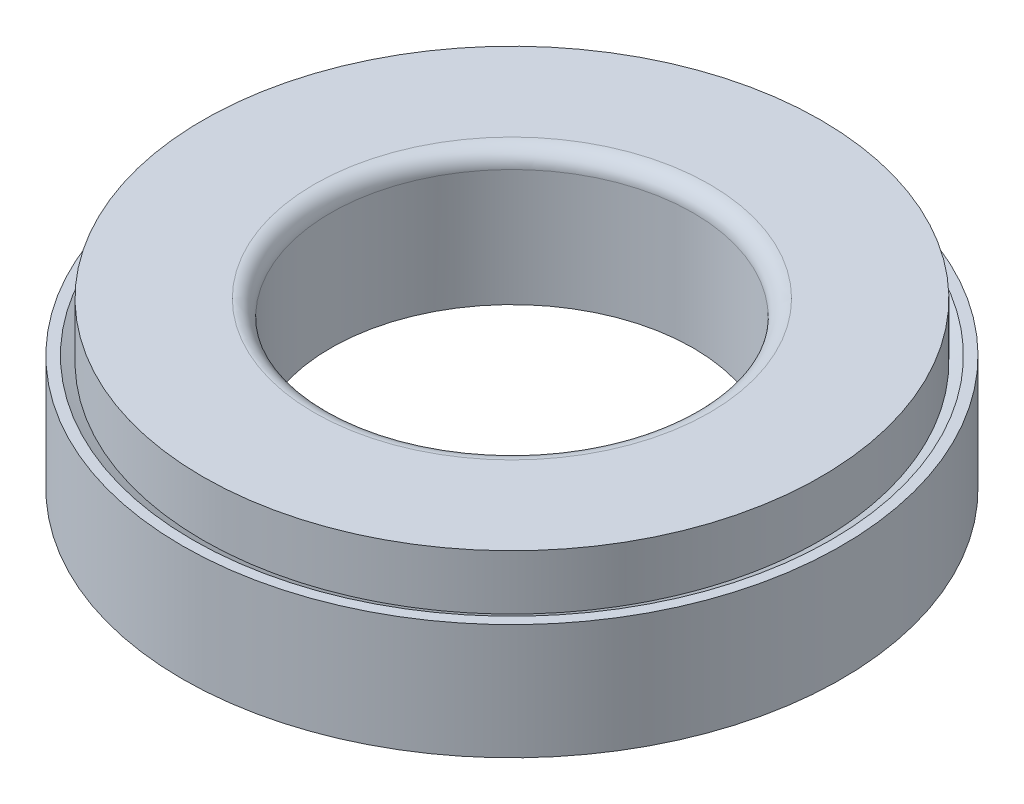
ISO-10303-21;
HEADER;
FILE_DESCRIPTION(('STEP AP214'),'2;1');
FILE_NAME('part.step','',(''),(''),'','','');
FILE_SCHEMA(('AUTOMOTIVE_DESIGN { 1 0 10303 214 1 1 1 1 }'));
ENDSEC;
DATA;
#1=APPLICATION_CONTEXT('core data for automotive mechanical design processes');
#2=APPLICATION_PROTOCOL_DEFINITION('international standard','automotive_design',2000,#1);
#3=PRODUCT_CONTEXT('',#1,'mechanical');
#4=PRODUCT('Part','Part','',(#3));
#5=PRODUCT_RELATED_PRODUCT_CATEGORY('part','',(#4));
#6=PRODUCT_DEFINITION_FORMATION('','',#4);
#7=PRODUCT_DEFINITION_CONTEXT('part definition',#1,'design');
#8=PRODUCT_DEFINITION('design','',#6,#7);
#9=PRODUCT_DEFINITION_SHAPE('','',#8);
#10=(LENGTH_UNIT() NAMED_UNIT(*) SI_UNIT(.MILLI.,.METRE.));
#11=(NAMED_UNIT(*) PLANE_ANGLE_UNIT() SI_UNIT($,.RADIAN.));
#12=(NAMED_UNIT(*) SI_UNIT($,.STERADIAN.) SOLID_ANGLE_UNIT());
#13=UNCERTAINTY_MEASURE_WITH_UNIT(LENGTH_MEASURE(1.E-05),#10,'distance_accuracy_value','');
#14=(GEOMETRIC_REPRESENTATION_CONTEXT(3) GLOBAL_UNCERTAINTY_ASSIGNED_CONTEXT((#13)) GLOBAL_UNIT_ASSIGNED_CONTEXT((#10,
#11,#12)) REPRESENTATION_CONTEXT('',''));
#15=CARTESIAN_POINT('',(0.,0.,0.));
#16=DIRECTION('',(0.,0.,1.));
#17=DIRECTION('',(1.,0.,0.));
#18=AXIS2_PLACEMENT_3D('',#15,#16,#17);
#19=CARTESIAN_POINT('',(0.,20.,0.));
#20=DIRECTION('',(0.,-1.,0.));
#21=DIRECTION('',(0.,0.,-1.));
#22=AXIS2_PLACEMENT_3D('',#19,#20,#21);
#23=CYLINDRICAL_SURFACE('',#22,37.5);
#24=CARTESIAN_POINT('',(0.,13.3200185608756,0.));
#25=DIRECTION('',(0.,1.,0.));
#26=DIRECTION('',(0.,0.,1.));
#27=AXIS2_PLACEMENT_3D('',#24,#25,#26);
#28=CIRCLE('',#27,37.5);
#29=CARTESIAN_POINT('',(0.,13.3200185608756,37.5));
#30=VERTEX_POINT('',#29);
#31=EDGE_CURVE('P0_E29',#30,#30,#28,.T.);
#32=ORIENTED_EDGE('',*,*,#31,.T.);
#33=EDGE_LOOP('',(#32));
#34=FACE_BOUND('',#33,.T.);
#35=CARTESIAN_POINT('',(0.,20.,0.));
#36=DIRECTION('',(0.,1.,0.));
#37=DIRECTION('',(0.,0.,1.));
#38=AXIS2_PLACEMENT_3D('',#35,#36,#37);
#39=CIRCLE('',#38,37.5);
#40=CARTESIAN_POINT('',(0.,20.,37.5));
#41=VERTEX_POINT('',#40);
#42=EDGE_CURVE('P0_E25',#41,#41,#39,.T.);
#43=ORIENTED_EDGE('',*,*,#42,.F.);
#44=EDGE_LOOP('',(#43));
#45=FACE_BOUND('',#44,.T.);
#46=ADVANCED_FACE('P0_F14',(#34,#45),#23,.T.);
#47=CARTESIAN_POINT('',(0.,20.,0.));
#48=DIRECTION('',(0.,1.,0.));
#49=DIRECTION('',(0.,0.,1.));
#50=AXIS2_PLACEMENT_3D('',#47,#48,#49);
#51=PLANE('',#50);
#52=CARTESIAN_POINT('',(0.,20.,0.));
#53=DIRECTION('',(0.,1.,0.));
#54=DIRECTION('',(0.,0.,1.));
#55=AXIS2_PLACEMENT_3D('',#52,#53,#54);
#56=CIRCLE('',#55,24.);
#57=CARTESIAN_POINT('',(0.,20.,24.));
#58=VERTEX_POINT('',#57);
#59=EDGE_CURVE('P0_E21',#58,#58,#56,.F.);
#60=ORIENTED_EDGE('',*,*,#59,.T.);
#61=EDGE_LOOP('',(#60));
#62=FACE_BOUND('',#61,.T.);
#63=ORIENTED_EDGE('',*,*,#42,.T.);
#64=EDGE_LOOP('',(#63));
#65=FACE_BOUND('',#64,.T.);
#66=ADVANCED_FACE('P0_F92',(#62,#65),#51,.T.);
#67=CARTESIAN_POINT('',(0.,83.7446428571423,0.));
#68=DIRECTION('',(-1.,0.,0.));
#69=DIRECTION('',(0.,-1.,0.));
#70=AXIS2_PLACEMENT_3D('',#67,#68,#69);
#71=SPHERICAL_SURFACE('',#70,79.7864506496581);
#72=CARTESIAN_POINT('',(0.,83.7446428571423,0.));
#73=DIRECTION('',(0.,1.,0.));
#74=DIRECTION('',(0.,0.,1.));
#75=AXIS2_PLACEMENT_3D('',#72,#73,#74);
#76=SPHERICAL_SURFACE('',#75,79.7864506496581);
#77=CARTESIAN_POINT('',(0.,8.40000000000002,0.));
#78=DIRECTION('',(0.,1.,0.));
#79=DIRECTION('',(0.,0.,1.));
#80=AXIS2_PLACEMENT_3D('',#77,#78,#79);
#81=CIRCLE('',#80,26.25);
#82=CARTESIAN_POINT('',(0.,8.40000000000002,26.25));
#83=VERTEX_POINT('',#82);
#84=EDGE_CURVE('P0_E49',#83,#83,#81,.T.);
#85=ORIENTED_EDGE('',*,*,#84,.T.);
#86=EDGE_LOOP('',(#85));
#87=FACE_BOUND('',#86,.T.);
#88=ORIENTED_EDGE('',*,*,#31,.F.);
#89=EDGE_LOOP('',(#88));
#90=FACE_BOUND('',#89,.T.);
#91=ADVANCED_FACE('P0_F53',(#87,#90),#76,.T.);
#92=CARTESIAN_POINT('',(0.,3.8,0.));
#93=DIRECTION('',(0.,1.,0.));
#94=DIRECTION('',(0.,0.,1.));
#95=AXIS2_PLACEMENT_3D('',#92,#93,#94);
#96=CYLINDRICAL_SURFACE('',#95,26.25);
#97=CARTESIAN_POINT('',(0.,6.1,0.));
#98=DIRECTION('',(0.,1.,0.));
#99=DIRECTION('',(0.,0.,1.));
#100=AXIS2_PLACEMENT_3D('',#97,#98,#99);
#101=CIRCLE('',#100,26.25);
#102=CARTESIAN_POINT('',(0.,6.1,26.25));
#103=VERTEX_POINT('',#102);
#104=EDGE_CURVE('P0_E40',#103,#103,#101,.T.);
#105=ORIENTED_EDGE('',*,*,#104,.F.);
#106=EDGE_LOOP('',(#105));
#107=FACE_BOUND('',#106,.T.);
#108=CARTESIAN_POINT('',(0.,3.8,0.));
#109=DIRECTION('',(0.,1.,0.));
#110=DIRECTION('',(0.,0.,1.));
#111=AXIS2_PLACEMENT_3D('',#108,#109,#110);
#112=CIRCLE('',#111,26.25);
#113=CARTESIAN_POINT('',(0.,3.8,26.25));
#114=VERTEX_POINT('',#113);
#115=EDGE_CURVE('P0_E33',#114,#114,#112,.T.);
#116=ORIENTED_EDGE('',*,*,#115,.T.);
#117=EDGE_LOOP('',(#116));
#118=FACE_BOUND('',#117,.T.);
#119=ADVANCED_FACE('P0_F75',(#107,#118),#96,.T.);
#120=CARTESIAN_POINT('',(0.,3.8,0.));
#121=DIRECTION('',(0.,1.,0.));
#122=DIRECTION('',(0.,0.,1.));
#123=AXIS2_PLACEMENT_3D('',#120,#121,#122);
#124=PLANE('',#123);
#125=CARTESIAN_POINT('',(0.,3.8,0.));
#126=DIRECTION('',(0.,-1.,0.));
#127=DIRECTION('',(0.,0.,-1.));
#128=AXIS2_PLACEMENT_3D('',#125,#126,#127);
#129=CIRCLE('',#128,22.);
#130=CARTESIAN_POINT('',(0.,3.8,-22.));
#131=VERTEX_POINT('',#130);
#132=EDGE_CURVE('P0_E37',#131,#131,#129,.T.);
#133=ORIENTED_EDGE('',*,*,#132,.F.);
#134=EDGE_LOOP('',(#133));
#135=FACE_BOUND('',#134,.T.);
#136=ORIENTED_EDGE('',*,*,#115,.F.);
#137=EDGE_LOOP('',(#136));
#138=FACE_BOUND('',#137,.T.);
#139=ADVANCED_FACE('P0_F78',(#135,#138),#124,.F.);
#140=CARTESIAN_POINT('',(0.,20.,0.));
#141=DIRECTION('',(0.,-1.,0.));
#142=DIRECTION('',(0.,0.,-1.));
#143=AXIS2_PLACEMENT_3D('',#140,#141,#142);
#144=CYLINDRICAL_SURFACE('',#143,22.);
#145=CARTESIAN_POINT('',(0.,18.,0.));
#146=DIRECTION('',(0.,1.,0.));
#147=DIRECTION('',(0.,0.,1.));
#148=AXIS2_PLACEMENT_3D('',#145,#146,#147);
#149=CIRCLE('',#148,22.);
#150=CARTESIAN_POINT('',(0.,18.,22.));
#151=VERTEX_POINT('',#150);
#152=EDGE_CURVE('P0_E10',#151,#151,#149,.T.);
#153=ORIENTED_EDGE('',*,*,#152,.T.);
#154=EDGE_LOOP('',(#153));
#155=FACE_BOUND('',#154,.T.);
#156=ORIENTED_EDGE('',*,*,#132,.T.);
#157=EDGE_LOOP('',(#156));
#158=FACE_BOUND('',#157,.T.);
#159=ADVANCED_FACE('P0_F71',(#155,#158),#144,.F.);
#160=CARTESIAN_POINT('',(-26.25,6.1,0.));
#161=DIRECTION('',(0.,-1.,0.));
#162=DIRECTION('',(0.,0.,-1.));
#163=AXIS2_PLACEMENT_3D('',#160,#161,#162);
#164=PLANE('',#163);
#165=CARTESIAN_POINT('',(0.,6.1,0.));
#166=DIRECTION('',(0.,1.,0.));
#167=DIRECTION('',(0.,0.,1.));
#168=AXIS2_PLACEMENT_3D('',#165,#166,#167);
#169=CIRCLE('',#168,24.125);
#170=CARTESIAN_POINT('',(0.,6.1,24.125));
#171=VERTEX_POINT('',#170);
#172=EDGE_CURVE('P0_E43',#171,#171,#169,.T.);
#173=ORIENTED_EDGE('',*,*,#172,.F.);
#174=EDGE_LOOP('',(#173));
#175=FACE_BOUND('',#174,.T.);
#176=ORIENTED_EDGE('',*,*,#104,.T.);
#177=EDGE_LOOP('',(#176));
#178=FACE_BOUND('',#177,.T.);
#179=ADVANCED_FACE('P0_F65',(#175,#178),#164,.F.);
#180=CARTESIAN_POINT('',(0.,20.,0.));
#181=DIRECTION('',(0.,1.,0.));
#182=DIRECTION('',(0.,0.,1.));
#183=AXIS2_PLACEMENT_3D('',#180,#181,#182);
#184=CYLINDRICAL_SURFACE('',#183,24.125);
#185=CARTESIAN_POINT('',(0.,8.40000000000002,0.));
#186=DIRECTION('',(0.,1.,0.));
#187=DIRECTION('',(0.,0.,1.));
#188=AXIS2_PLACEMENT_3D('',#185,#186,#187);
#189=CIRCLE('',#188,24.125);
#190=CARTESIAN_POINT('',(0.,8.40000000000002,24.125));
#191=VERTEX_POINT('',#190);
#192=EDGE_CURVE('P0_E46',#191,#191,#189,.T.);
#193=ORIENTED_EDGE('',*,*,#192,.F.);
#194=EDGE_LOOP('',(#193));
#195=FACE_BOUND('',#194,.T.);
#196=ORIENTED_EDGE('',*,*,#172,.T.);
#197=EDGE_LOOP('',(#196));
#198=FACE_BOUND('',#197,.T.);
#199=ADVANCED_FACE('P0_F59',(#195,#198),#184,.T.);
#200=CARTESIAN_POINT('',(-26.25,8.40000000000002,0.));
#201=DIRECTION('',(0.,1.,0.));
#202=DIRECTION('',(0.,0.,1.));
#203=AXIS2_PLACEMENT_3D('',#200,#201,#202);
#204=PLANE('',#203);
#205=ORIENTED_EDGE('',*,*,#84,.F.);
#206=EDGE_LOOP('',(#205));
#207=FACE_BOUND('',#206,.T.);
#208=ORIENTED_EDGE('',*,*,#192,.T.);
#209=EDGE_LOOP('',(#208));
#210=FACE_BOUND('',#209,.T.);
#211=ADVANCED_FACE('P0_F56',(#207,#210),#204,.F.);
#212=CARTESIAN_POINT('',(0.,18.,0.));
#213=DIRECTION('',(0.,1.,0.));
#214=DIRECTION('',(0.,0.,1.));
#215=AXIS2_PLACEMENT_3D('',#212,#213,#214);
#216=TOROIDAL_SURFACE('',#215,24.,2.);
#217=ORIENTED_EDGE('',*,*,#152,.F.);
#218=EDGE_LOOP('',(#217));
#219=FACE_BOUND('',#218,.T.);
#220=ORIENTED_EDGE('',*,*,#59,.F.);
#221=EDGE_LOOP('',(#220));
#222=FACE_BOUND('',#221,.T.);
#223=ADVANCED_FACE('P0_F16',(#219,#222),#216,.T.);
#224=CLOSED_SHELL('',(#46,#66,#91,#119,#139,#159,#179,#199,#211,#223));
#225=MANIFOLD_SOLID_BREP('P0_B1',#224);
#226=CARTESIAN_POINT('',(0.,14.,0.));
#227=DIRECTION('',(0.,-1.,0.));
#228=DIRECTION('',(0.,0.,-1.));
#229=AXIS2_PLACEMENT_3D('',#226,#227,#228);
#230=CYLINDRICAL_SURFACE('',#229,40.);
#231=CARTESIAN_POINT('',(0.,14.,0.));
#232=DIRECTION('',(0.,1.,0.));
#233=DIRECTION('',(0.,0.,1.));
#234=AXIS2_PLACEMENT_3D('',#231,#232,#233);
#235=CIRCLE('',#234,40.);
#236=CARTESIAN_POINT('',(0.,14.,40.));
#237=VERTEX_POINT('',#236);
#238=EDGE_CURVE('P1_E9',#237,#237,#235,.T.);
#239=ORIENTED_EDGE('',*,*,#238,.F.);
#240=EDGE_LOOP('',(#239));
#241=FACE_BOUND('',#240,.T.);
#242=CARTESIAN_POINT('',(0.,0.,0.));
#243=DIRECTION('',(0.,1.,0.));
#244=DIRECTION('',(0.,0.,1.));
#245=AXIS2_PLACEMENT_3D('',#242,#243,#244);
#246=CIRCLE('',#245,40.);
#247=CARTESIAN_POINT('',(0.,0.,40.));
#248=VERTEX_POINT('',#247);
#249=EDGE_CURVE('P1_E20',#248,#248,#246,.T.);
#250=ORIENTED_EDGE('',*,*,#249,.T.);
#251=EDGE_LOOP('',(#250));
#252=FACE_BOUND('',#251,.T.);
#253=ADVANCED_FACE('P1_F13',(#241,#252),#230,.T.);
#254=CARTESIAN_POINT('',(0.,14.,0.));
#255=DIRECTION('',(0.,1.,0.));
#256=DIRECTION('',(0.,0.,1.));
#257=AXIS2_PLACEMENT_3D('',#254,#255,#256);
#258=PLANE('',#257);
#259=CARTESIAN_POINT('',(0.,14.,0.));
#260=DIRECTION('',(0.,1.,0.));
#261=DIRECTION('',(0.,0.,1.));
#262=AXIS2_PLACEMENT_3D('',#259,#260,#261);
#263=CIRCLE('',#262,38.75);
#264=CARTESIAN_POINT('',(0.,14.,38.75));
#265=VERTEX_POINT('',#264);
#266=EDGE_CURVE('P1_E35',#265,#265,#263,.T.);
#267=ORIENTED_EDGE('',*,*,#266,.F.);
#268=EDGE_LOOP('',(#267));
#269=FACE_BOUND('',#268,.T.);
#270=ORIENTED_EDGE('',*,*,#238,.T.);
#271=EDGE_LOOP('',(#270));
#272=FACE_BOUND('',#271,.T.);
#273=ADVANCED_FACE('P1_F55',(#269,#272),#258,.T.);
#274=CARTESIAN_POINT('',(0.,0.,0.));
#275=DIRECTION('',(0.,1.,0.));
#276=DIRECTION('',(0.,0.,1.));
#277=AXIS2_PLACEMENT_3D('',#274,#275,#276);
#278=PLANE('',#277);
#279=CARTESIAN_POINT('',(0.,0.,0.));
#280=DIRECTION('',(0.,-1.,0.));
#281=DIRECTION('',(0.,0.,-1.));
#282=AXIS2_PLACEMENT_3D('',#279,#280,#281);
#283=CIRCLE('',#282,30.5);
#284=CARTESIAN_POINT('',(0.,0.,-30.5));
#285=VERTEX_POINT('',#284);
#286=EDGE_CURVE('P1_E27',#285,#285,#283,.T.);
#287=ORIENTED_EDGE('',*,*,#286,.F.);
#288=EDGE_LOOP('',(#287));
#289=FACE_BOUND('',#288,.T.);
#290=ORIENTED_EDGE('',*,*,#249,.F.);
#291=EDGE_LOOP('',(#290));
#292=FACE_BOUND('',#291,.T.);
#293=ADVANCED_FACE('P1_F60',(#289,#292),#278,.F.);
#294=CARTESIAN_POINT('',(0.,7.,0.));
#295=DIRECTION('',(0.,-1.,0.));
#296=DIRECTION('',(0.,0.,-1.));
#297=AXIS2_PLACEMENT_3D('',#294,#295,#296);
#298=CYLINDRICAL_SURFACE('',#297,30.5);
#299=CARTESIAN_POINT('',(0.,7.,0.));
#300=DIRECTION('',(0.,-1.,0.));
#301=DIRECTION('',(0.,0.,-1.));
#302=AXIS2_PLACEMENT_3D('',#299,#300,#301);
#303=CIRCLE('',#302,30.5);
#304=CARTESIAN_POINT('',(0.,7.,-30.5));
#305=VERTEX_POINT('',#304);
#306=EDGE_CURVE('P1_E25',#305,#305,#303,.T.);
#307=ORIENTED_EDGE('',*,*,#306,.F.);
#308=EDGE_LOOP('',(#307));
#309=FACE_BOUND('',#308,.T.);
#310=ORIENTED_EDGE('',*,*,#286,.T.);
#311=EDGE_LOOP('',(#310));
#312=FACE_BOUND('',#311,.T.);
#313=ADVANCED_FACE('P1_F67',(#309,#312),#298,.F.);
#314=CARTESIAN_POINT('',(0.,7.,0.));
#315=DIRECTION('',(0.,-1.,0.));
#316=DIRECTION('',(0.,0.,-1.));
#317=AXIS2_PLACEMENT_3D('',#314,#315,#316);
#318=PLANE('',#317);
#319=CARTESIAN_POINT('',(0.,7.,0.));
#320=DIRECTION('',(0.,-1.,0.));
#321=DIRECTION('',(0.,0.,-1.));
#322=AXIS2_PLACEMENT_3D('',#319,#320,#321);
#323=CIRCLE('',#322,26.25);
#324=CARTESIAN_POINT('',(0.,7.,-26.25));
#325=VERTEX_POINT('',#324);
#326=EDGE_CURVE('P1_E30',#325,#325,#323,.T.);
#327=ORIENTED_EDGE('',*,*,#326,.F.);
#328=EDGE_LOOP('',(#327));
#329=FACE_BOUND('',#328,.T.);
#330=ORIENTED_EDGE('',*,*,#306,.T.);
#331=EDGE_LOOP('',(#330));
#332=FACE_BOUND('',#331,.T.);
#333=ADVANCED_FACE('P1_F52',(#329,#332),#318,.T.);
#334=CARTESIAN_POINT('',(0.,14.,0.));
#335=DIRECTION('',(0.,-1.,0.));
#336=DIRECTION('',(0.,0.,-1.));
#337=AXIS2_PLACEMENT_3D('',#334,#335,#336);
#338=CYLINDRICAL_SURFACE('',#337,26.25);
#339=CARTESIAN_POINT('',(0.,8.4,0.));
#340=DIRECTION('',(0.,1.,0.));
#341=DIRECTION('',(0.,0.,1.));
#342=AXIS2_PLACEMENT_3D('',#339,#340,#341);
#343=CIRCLE('',#342,26.25);
#344=CARTESIAN_POINT('',(0.,8.4,26.25));
#345=VERTEX_POINT('',#344);
#346=EDGE_CURVE('P1_E16',#345,#345,#343,.T.);
#347=ORIENTED_EDGE('',*,*,#346,.T.);
#348=EDGE_LOOP('',(#347));
#349=FACE_BOUND('',#348,.T.);
#350=ORIENTED_EDGE('',*,*,#326,.T.);
#351=EDGE_LOOP('',(#350));
#352=FACE_BOUND('',#351,.T.);
#353=ADVANCED_FACE('P1_F42',(#349,#352),#338,.F.);
#354=CARTESIAN_POINT('',(0.,83.7446428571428,0.));
#355=DIRECTION('',(-1.,0.,0.));
#356=DIRECTION('',(0.,1.,0.));
#357=AXIS2_PLACEMENT_3D('',#354,#355,#356);
#358=SPHERICAL_SURFACE('',#357,79.7864506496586);
#359=CARTESIAN_POINT('',(0.,83.7446428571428,0.));
#360=DIRECTION('',(0.,1.,0.));
#361=DIRECTION('',(0.,0.,1.));
#362=AXIS2_PLACEMENT_3D('',#359,#360,#361);
#363=SPHERICAL_SURFACE('',#362,79.7864506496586);
#364=ORIENTED_EDGE('',*,*,#266,.T.);
#365=EDGE_LOOP('',(#364));
#366=FACE_BOUND('',#365,.T.);
#367=ORIENTED_EDGE('',*,*,#346,.F.);
#368=EDGE_LOOP('',(#367));
#369=FACE_BOUND('',#368,.T.);
#370=ADVANCED_FACE('P1_F45',(#366,#369),#363,.F.);
#371=CLOSED_SHELL('',(#253,#273,#293,#313,#333,#353,#370));
#372=MANIFOLD_SOLID_BREP('P1_B1',#371);
#373=ADVANCED_BREP_SHAPE_REPRESENTATION('',(#18,#225,#372),#14);
#374=SHAPE_DEFINITION_REPRESENTATION(#9,#373);
ENDSEC;
END-ISO-10303-21;
